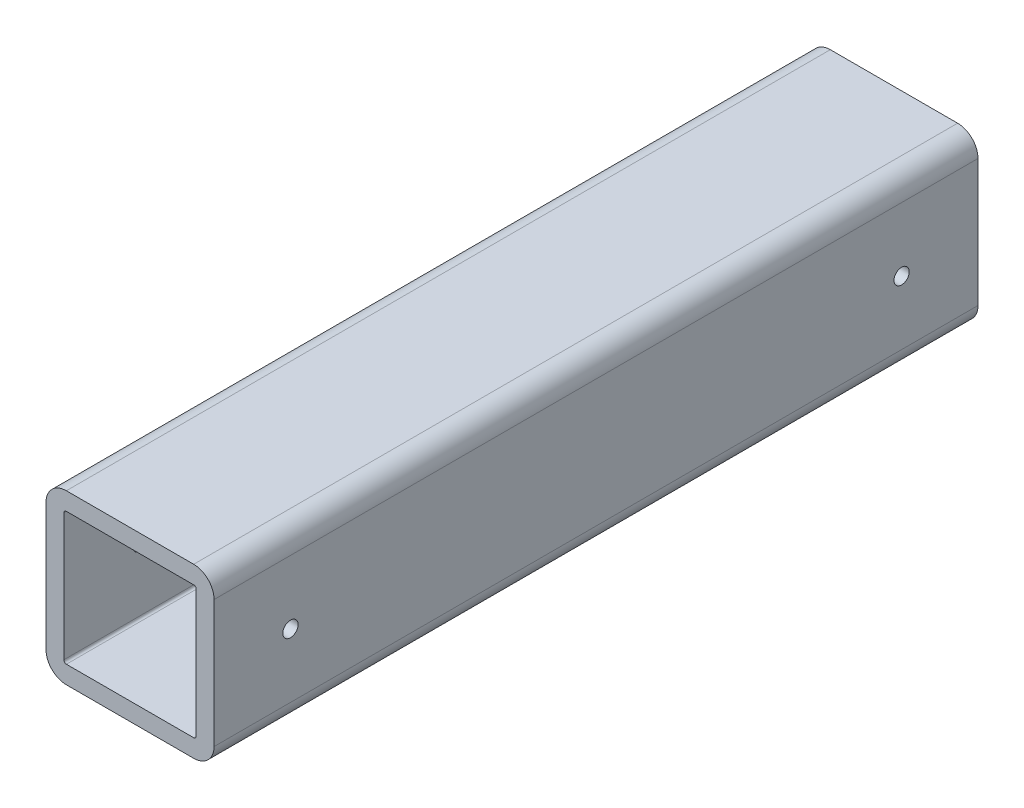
ISO-10303-21;
HEADER;
FILE_DESCRIPTION(('STEP AP214'),'2;1');
FILE_NAME('part.step','',(''),(''),'','','');
FILE_SCHEMA(('AUTOMOTIVE_DESIGN { 1 0 10303 214 1 1 1 1 }'));
ENDSEC;
DATA;
#1=APPLICATION_CONTEXT('core data for automotive mechanical design processes');
#2=APPLICATION_PROTOCOL_DEFINITION('international standard','automotive_design',2000,#1);
#3=PRODUCT_CONTEXT('',#1,'mechanical');
#4=PRODUCT('Part','Part','',(#3));
#5=PRODUCT_RELATED_PRODUCT_CATEGORY('part','',(#4));
#6=PRODUCT_DEFINITION_FORMATION('','',#4);
#7=PRODUCT_DEFINITION_CONTEXT('part definition',#1,'design');
#8=PRODUCT_DEFINITION('design','',#6,#7);
#9=PRODUCT_DEFINITION_SHAPE('','',#8);
#10=(LENGTH_UNIT() NAMED_UNIT(*) SI_UNIT(.MILLI.,.METRE.));
#11=(NAMED_UNIT(*) PLANE_ANGLE_UNIT() SI_UNIT($,.RADIAN.));
#12=(NAMED_UNIT(*) SI_UNIT($,.STERADIAN.) SOLID_ANGLE_UNIT());
#13=UNCERTAINTY_MEASURE_WITH_UNIT(LENGTH_MEASURE(1.E-05),#10,'distance_accuracy_value','');
#14=(GEOMETRIC_REPRESENTATION_CONTEXT(3) GLOBAL_UNCERTAINTY_ASSIGNED_CONTEXT((#13)) GLOBAL_UNIT_ASSIGNED_CONTEXT((#10,
#11,#12)) REPRESENTATION_CONTEXT('',''));
#15=CARTESIAN_POINT('',(0.,0.,0.));
#16=DIRECTION('',(0.,0.,1.));
#17=DIRECTION('',(1.,0.,0.));
#18=AXIS2_PLACEMENT_3D('',#15,#16,#17);
#19=CARTESIAN_POINT('',(58.,-58.,300.));
#20=DIRECTION('',(0.,0.,1.));
#21=DIRECTION('',(1.,0.,0.));
#22=AXIS2_PLACEMENT_3D('',#19,#20,#21);
#23=PLANE('',#22);
#24=CARTESIAN_POINT('',(58.,-58.,300.));
#25=DIRECTION('',(0.,0.,1.));
#26=DIRECTION('',(1.,0.,0.));
#27=AXIS2_PLACEMENT_3D('',#24,#25,#26);
#28=CIRCLE('',#27,8.);
#29=CARTESIAN_POINT('',(58.,-66.,300.));
#30=VERTEX_POINT('',#29);
#31=CARTESIAN_POINT('',(66.,-58.,300.));
#32=VERTEX_POINT('',#31);
#33=EDGE_CURVE('E231',#30,#32,#28,.T.);
#34=ORIENTED_EDGE('',*,*,#33,.T.);
#35=DIRECTION('',(0.,1.,0.));
#36=VECTOR('',#35,1.);
#37=CARTESIAN_POINT('',(66.,-8.,300.));
#38=LINE('',#37,#36);
#39=CARTESIAN_POINT('',(66.,-8.,300.));
#40=VERTEX_POINT('',#39);
#41=EDGE_CURVE('E234',#32,#40,#38,.T.);
#42=ORIENTED_EDGE('',*,*,#41,.T.);
#43=CARTESIAN_POINT('',(58.,-8.,300.));
#44=DIRECTION('',(0.,0.,1.));
#45=DIRECTION('',(1.,0.,0.));
#46=AXIS2_PLACEMENT_3D('',#43,#44,#45);
#47=CIRCLE('',#46,8.);
#48=CARTESIAN_POINT('',(58.,0.,300.));
#49=VERTEX_POINT('',#48);
#50=EDGE_CURVE('E236',#40,#49,#47,.T.);
#51=ORIENTED_EDGE('',*,*,#50,.T.);
#52=DIRECTION('',(-1.,0.,0.));
#53=VECTOR('',#52,1.);
#54=CARTESIAN_POINT('',(8.,0.,300.));
#55=LINE('',#54,#53);
#56=CARTESIAN_POINT('',(8.,0.,300.));
#57=VERTEX_POINT('',#56);
#58=EDGE_CURVE('E238',#49,#57,#55,.T.);
#59=ORIENTED_EDGE('',*,*,#58,.T.);
#60=CARTESIAN_POINT('',(8.,-8.,300.));
#61=DIRECTION('',(0.,0.,1.));
#62=DIRECTION('',(1.,0.,0.));
#63=AXIS2_PLACEMENT_3D('',#60,#61,#62);
#64=CIRCLE('',#63,8.);
#65=CARTESIAN_POINT('',(0.,-8.,300.));
#66=VERTEX_POINT('',#65);
#67=EDGE_CURVE('E240',#57,#66,#64,.T.);
#68=ORIENTED_EDGE('',*,*,#67,.T.);
#69=DIRECTION('',(0.,-1.,0.));
#70=VECTOR('',#69,1.);
#71=CARTESIAN_POINT('',(0.,-8.,300.));
#72=LINE('',#71,#70);
#73=CARTESIAN_POINT('',(0.,-58.,300.));
#74=VERTEX_POINT('',#73);
#75=EDGE_CURVE('E242',#66,#74,#72,.T.);
#76=ORIENTED_EDGE('',*,*,#75,.T.);
#77=CARTESIAN_POINT('',(8.00000000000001,-58.,300.));
#78=DIRECTION('',(0.,0.,1.));
#79=DIRECTION('',(1.,0.,0.));
#80=AXIS2_PLACEMENT_3D('',#77,#78,#79);
#81=CIRCLE('',#80,8.);
#82=CARTESIAN_POINT('',(8.00000000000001,-66.,300.));
#83=VERTEX_POINT('',#82);
#84=EDGE_CURVE('E244',#74,#83,#81,.T.);
#85=ORIENTED_EDGE('',*,*,#84,.T.);
#86=DIRECTION('',(1.,0.,0.));
#87=VECTOR('',#86,1.);
#88=CARTESIAN_POINT('',(8.00000000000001,-66.,300.));
#89=LINE('',#88,#87);
#90=EDGE_CURVE('E246',#83,#30,#89,.T.);
#91=ORIENTED_EDGE('',*,*,#90,.T.);
#92=EDGE_LOOP('',(#34,#42,#51,#59,#68,#76,#85,#91));
#93=FACE_BOUND('',#92,.T.);
#94=DIRECTION('',(0.,-1.,0.));
#95=VECTOR('',#94,1.);
#96=CARTESIAN_POINT('',(7.,-8.,300.));
#97=LINE('',#96,#95);
#98=CARTESIAN_POINT('',(7.,-8.,300.));
#99=VERTEX_POINT('',#98);
#100=CARTESIAN_POINT('',(7.00000000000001,-58.,300.));
#101=VERTEX_POINT('',#100);
#102=EDGE_CURVE('E189',#99,#101,#97,.T.);
#103=ORIENTED_EDGE('',*,*,#102,.F.);
#104=CARTESIAN_POINT('',(8.,-8.,300.));
#105=DIRECTION('',(0.,0.,1.));
#106=DIRECTION('',(1.,0.,0.));
#107=AXIS2_PLACEMENT_3D('',#104,#105,#106);
#108=CIRCLE('',#107,1.);
#109=CARTESIAN_POINT('',(8.,-7.,300.));
#110=VERTEX_POINT('',#109);
#111=EDGE_CURVE('E161',#110,#99,#108,.T.);
#112=ORIENTED_EDGE('',*,*,#111,.F.);
#113=DIRECTION('',(-1.,0.,0.));
#114=VECTOR('',#113,1.);
#115=CARTESIAN_POINT('',(8.,-7.,300.));
#116=LINE('',#115,#114);
#117=CARTESIAN_POINT('',(58.,-7.,300.));
#118=VERTEX_POINT('',#117);
#119=EDGE_CURVE('E201',#118,#110,#116,.T.);
#120=ORIENTED_EDGE('',*,*,#119,.F.);
#121=CARTESIAN_POINT('',(58.,-8.,300.));
#122=DIRECTION('',(0.,0.,1.));
#123=DIRECTION('',(1.,0.,0.));
#124=AXIS2_PLACEMENT_3D('',#121,#122,#123);
#125=CIRCLE('',#124,1.);
#126=CARTESIAN_POINT('',(59.,-8.,300.));
#127=VERTEX_POINT('',#126);
#128=EDGE_CURVE('E199',#127,#118,#125,.T.);
#129=ORIENTED_EDGE('',*,*,#128,.F.);
#130=DIRECTION('',(0.,1.,0.));
#131=VECTOR('',#130,1.);
#132=CARTESIAN_POINT('',(59.,-8.,300.));
#133=LINE('',#132,#131);
#134=CARTESIAN_POINT('',(59.,-58.,300.));
#135=VERTEX_POINT('',#134);
#136=EDGE_CURVE('E197',#135,#127,#133,.T.);
#137=ORIENTED_EDGE('',*,*,#136,.F.);
#138=CARTESIAN_POINT('',(58.,-58.,300.));
#139=DIRECTION('',(0.,0.,1.));
#140=DIRECTION('',(1.,0.,0.));
#141=AXIS2_PLACEMENT_3D('',#138,#139,#140);
#142=CIRCLE('',#141,0.999999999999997);
#143=CARTESIAN_POINT('',(58.,-59.,300.));
#144=VERTEX_POINT('',#143);
#145=EDGE_CURVE('E195',#144,#135,#142,.T.);
#146=ORIENTED_EDGE('',*,*,#145,.F.);
#147=DIRECTION('',(1.,0.,0.));
#148=VECTOR('',#147,1.);
#149=CARTESIAN_POINT('',(8.00000000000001,-59.,300.));
#150=LINE('',#149,#148);
#151=CARTESIAN_POINT('',(8.00000000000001,-59.,300.));
#152=VERTEX_POINT('',#151);
#153=EDGE_CURVE('E193',#152,#144,#150,.T.);
#154=ORIENTED_EDGE('',*,*,#153,.F.);
#155=CARTESIAN_POINT('',(8.00000000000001,-58.,300.));
#156=DIRECTION('',(0.,0.,1.));
#157=DIRECTION('',(1.,0.,0.));
#158=AXIS2_PLACEMENT_3D('',#155,#156,#157);
#159=CIRCLE('',#158,1.);
#160=EDGE_CURVE('E191',#101,#152,#159,.T.);
#161=ORIENTED_EDGE('',*,*,#160,.F.);
#162=EDGE_LOOP('',(#103,#112,#120,#129,#137,#146,#154,#161));
#163=FACE_BOUND('',#162,.T.);
#164=ADVANCED_FACE('F31',(#93,#163),#23,.T.);
#165=CARTESIAN_POINT('',(58.,-58.,0.));
#166=DIRECTION('',(0.,0.,1.));
#167=DIRECTION('',(1.,0.,0.));
#168=AXIS2_PLACEMENT_3D('',#165,#166,#167);
#169=PLANE('',#168);
#170=CARTESIAN_POINT('',(58.,-58.,0.));
#171=DIRECTION('',(0.,0.,1.));
#172=DIRECTION('',(1.,0.,0.));
#173=AXIS2_PLACEMENT_3D('',#170,#171,#172);
#174=CIRCLE('',#173,8.);
#175=CARTESIAN_POINT('',(58.,-66.,0.));
#176=VERTEX_POINT('',#175);
#177=CARTESIAN_POINT('',(66.,-58.,0.));
#178=VERTEX_POINT('',#177);
#179=EDGE_CURVE('E162',#176,#178,#174,.T.);
#180=ORIENTED_EDGE('',*,*,#179,.F.);
#181=DIRECTION('',(1.,0.,0.));
#182=VECTOR('',#181,1.);
#183=CARTESIAN_POINT('',(8.00000000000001,-66.,0.));
#184=LINE('',#183,#182);
#185=CARTESIAN_POINT('',(8.00000000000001,-66.,0.));
#186=VERTEX_POINT('',#185);
#187=EDGE_CURVE('E229',#186,#176,#184,.T.);
#188=ORIENTED_EDGE('',*,*,#187,.F.);
#189=CARTESIAN_POINT('',(8.00000000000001,-58.,0.));
#190=DIRECTION('',(0.,0.,1.));
#191=DIRECTION('',(1.,0.,0.));
#192=AXIS2_PLACEMENT_3D('',#189,#190,#191);
#193=CIRCLE('',#192,8.);
#194=CARTESIAN_POINT('',(0.,-58.,0.));
#195=VERTEX_POINT('',#194);
#196=EDGE_CURVE('E227',#195,#186,#193,.T.);
#197=ORIENTED_EDGE('',*,*,#196,.F.);
#198=DIRECTION('',(0.,-1.,0.));
#199=VECTOR('',#198,1.);
#200=CARTESIAN_POINT('',(0.,-8.,0.));
#201=LINE('',#200,#199);
#202=CARTESIAN_POINT('',(0.,-8.,0.));
#203=VERTEX_POINT('',#202);
#204=EDGE_CURVE('E225',#203,#195,#201,.T.);
#205=ORIENTED_EDGE('',*,*,#204,.F.);
#206=CARTESIAN_POINT('',(8.,-8.,0.));
#207=DIRECTION('',(0.,0.,1.));
#208=DIRECTION('',(1.,0.,0.));
#209=AXIS2_PLACEMENT_3D('',#206,#207,#208);
#210=CIRCLE('',#209,8.);
#211=CARTESIAN_POINT('',(8.,0.,0.));
#212=VERTEX_POINT('',#211);
#213=EDGE_CURVE('E223',#212,#203,#210,.T.);
#214=ORIENTED_EDGE('',*,*,#213,.F.);
#215=DIRECTION('',(-1.,0.,0.));
#216=VECTOR('',#215,1.);
#217=CARTESIAN_POINT('',(8.,0.,0.));
#218=LINE('',#217,#216);
#219=CARTESIAN_POINT('',(58.,0.,0.));
#220=VERTEX_POINT('',#219);
#221=EDGE_CURVE('E221',#220,#212,#218,.T.);
#222=ORIENTED_EDGE('',*,*,#221,.F.);
#223=CARTESIAN_POINT('',(58.,-8.,0.));
#224=DIRECTION('',(0.,0.,1.));
#225=DIRECTION('',(1.,0.,0.));
#226=AXIS2_PLACEMENT_3D('',#223,#224,#225);
#227=CIRCLE('',#226,8.);
#228=CARTESIAN_POINT('',(66.,-8.,0.));
#229=VERTEX_POINT('',#228);
#230=EDGE_CURVE('E219',#229,#220,#227,.T.);
#231=ORIENTED_EDGE('',*,*,#230,.F.);
#232=DIRECTION('',(0.,1.,0.));
#233=VECTOR('',#232,1.);
#234=CARTESIAN_POINT('',(66.,-8.,0.));
#235=LINE('',#234,#233);
#236=EDGE_CURVE('E217',#178,#229,#235,.T.);
#237=ORIENTED_EDGE('',*,*,#236,.F.);
#238=EDGE_LOOP('',(#180,#188,#197,#205,#214,#222,#231,#237));
#239=FACE_BOUND('',#238,.T.);
#240=CARTESIAN_POINT('',(8.,-8.,0.));
#241=DIRECTION('',(0.,0.,1.));
#242=DIRECTION('',(1.,0.,0.));
#243=AXIS2_PLACEMENT_3D('',#240,#241,#242);
#244=CIRCLE('',#243,1.);
#245=CARTESIAN_POINT('',(8.,-7.,0.));
#246=VERTEX_POINT('',#245);
#247=CARTESIAN_POINT('',(7.,-8.,0.));
#248=VERTEX_POINT('',#247);
#249=EDGE_CURVE('E56',#246,#248,#244,.T.);
#250=ORIENTED_EDGE('',*,*,#249,.T.);
#251=DIRECTION('',(0.,-1.,0.));
#252=VECTOR('',#251,1.);
#253=CARTESIAN_POINT('',(7.,-8.,0.));
#254=LINE('',#253,#252);
#255=CARTESIAN_POINT('',(7.00000000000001,-58.,0.));
#256=VERTEX_POINT('',#255);
#257=EDGE_CURVE('E148',#248,#256,#254,.T.);
#258=ORIENTED_EDGE('',*,*,#257,.T.);
#259=CARTESIAN_POINT('',(8.00000000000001,-58.,0.));
#260=DIRECTION('',(0.,0.,1.));
#261=DIRECTION('',(1.,0.,0.));
#262=AXIS2_PLACEMENT_3D('',#259,#260,#261);
#263=CIRCLE('',#262,1.);
#264=CARTESIAN_POINT('',(8.00000000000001,-59.,0.));
#265=VERTEX_POINT('',#264);
#266=EDGE_CURVE('E157',#256,#265,#263,.T.);
#267=ORIENTED_EDGE('',*,*,#266,.T.);
#268=DIRECTION('',(1.,0.,0.));
#269=VECTOR('',#268,1.);
#270=CARTESIAN_POINT('',(8.00000000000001,-59.,0.));
#271=LINE('',#270,#269);
#272=CARTESIAN_POINT('',(58.,-59.,0.));
#273=VERTEX_POINT('',#272);
#274=EDGE_CURVE('E176',#265,#273,#271,.T.);
#275=ORIENTED_EDGE('',*,*,#274,.T.);
#276=CARTESIAN_POINT('',(58.,-58.,0.));
#277=DIRECTION('',(0.,0.,1.));
#278=DIRECTION('',(1.,0.,0.));
#279=AXIS2_PLACEMENT_3D('',#276,#277,#278);
#280=CIRCLE('',#279,0.999999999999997);
#281=CARTESIAN_POINT('',(59.,-58.,0.));
#282=VERTEX_POINT('',#281);
#283=EDGE_CURVE('E179',#273,#282,#280,.T.);
#284=ORIENTED_EDGE('',*,*,#283,.T.);
#285=DIRECTION('',(0.,1.,0.));
#286=VECTOR('',#285,1.);
#287=CARTESIAN_POINT('',(59.,-8.,0.));
#288=LINE('',#287,#286);
#289=CARTESIAN_POINT('',(59.,-8.,0.));
#290=VERTEX_POINT('',#289);
#291=EDGE_CURVE('E182',#282,#290,#288,.T.);
#292=ORIENTED_EDGE('',*,*,#291,.T.);
#293=CARTESIAN_POINT('',(58.,-8.,0.));
#294=DIRECTION('',(0.,0.,1.));
#295=DIRECTION('',(1.,0.,0.));
#296=AXIS2_PLACEMENT_3D('',#293,#294,#295);
#297=CIRCLE('',#296,1.);
#298=CARTESIAN_POINT('',(58.,-7.,0.));
#299=VERTEX_POINT('',#298);
#300=EDGE_CURVE('E185',#290,#299,#297,.T.);
#301=ORIENTED_EDGE('',*,*,#300,.T.);
#302=DIRECTION('',(-1.,0.,0.));
#303=VECTOR('',#302,1.);
#304=CARTESIAN_POINT('',(8.,-7.,0.));
#305=LINE('',#304,#303);
#306=EDGE_CURVE('E167',#299,#246,#305,.T.);
#307=ORIENTED_EDGE('',*,*,#306,.T.);
#308=EDGE_LOOP('',(#250,#258,#267,#275,#284,#292,#301,#307));
#309=FACE_BOUND('',#308,.T.);
#310=ADVANCED_FACE('F165',(#239,#309),#169,.F.);
#311=CARTESIAN_POINT('',(58.,-58.,300.));
#312=DIRECTION('',(0.,0.,-1.));
#313=DIRECTION('',(-1.,0.,0.));
#314=AXIS2_PLACEMENT_3D('',#311,#312,#313);
#315=CYLINDRICAL_SURFACE('',#314,8.);
#316=ORIENTED_EDGE('',*,*,#179,.T.);
#317=DIRECTION('',(0.,0.,-1.));
#318=VECTOR('',#317,1.);
#319=CARTESIAN_POINT('',(66.,-58.,300.));
#320=LINE('',#319,#318);
#321=EDGE_CURVE('E11',#32,#178,#320,.T.);
#322=ORIENTED_EDGE('',*,*,#321,.F.);
#323=ORIENTED_EDGE('',*,*,#33,.F.);
#324=DIRECTION('',(0.,0.,-1.));
#325=VECTOR('',#324,1.);
#326=CARTESIAN_POINT('',(58.,-66.,300.));
#327=LINE('',#326,#325);
#328=EDGE_CURVE('E248',#30,#176,#327,.T.);
#329=ORIENTED_EDGE('',*,*,#328,.T.);
#330=EDGE_LOOP('',(#316,#322,#323,#329));
#331=FACE_BOUND('',#330,.T.);
#332=ADVANCED_FACE('F33',(#331),#315,.T.);
#333=CARTESIAN_POINT('',(66.,-8.,300.));
#334=DIRECTION('',(-1.,0.,0.));
#335=DIRECTION('',(0.,0.,1.));
#336=AXIS2_PLACEMENT_3D('',#333,#334,#335);
#337=PLANE('',#336);
#338=CARTESIAN_POINT('',(66.,-33.,270.));
#339=DIRECTION('',(-1.,0.,0.));
#340=DIRECTION('',(0.,-1.,0.));
#341=AXIS2_PLACEMENT_3D('',#338,#339,#340);
#342=CIRCLE('',#341,2.99999999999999);
#343=CARTESIAN_POINT('',(66.,-36.,270.));
#344=VERTEX_POINT('',#343);
#345=EDGE_CURVE('E281',#344,#344,#342,.T.);
#346=ORIENTED_EDGE('',*,*,#345,.T.);
#347=EDGE_LOOP('',(#346));
#348=FACE_BOUND('',#347,.T.);
#349=CARTESIAN_POINT('',(66.,-33.,30.));
#350=DIRECTION('',(-1.,0.,0.));
#351=DIRECTION('',(0.,-1.,0.));
#352=AXIS2_PLACEMENT_3D('',#349,#350,#351);
#353=CIRCLE('',#352,3.);
#354=CARTESIAN_POINT('',(66.,-36.,30.));
#355=VERTEX_POINT('',#354);
#356=EDGE_CURVE('E268',#355,#355,#353,.T.);
#357=ORIENTED_EDGE('',*,*,#356,.T.);
#358=EDGE_LOOP('',(#357));
#359=FACE_BOUND('',#358,.T.);
#360=ORIENTED_EDGE('',*,*,#236,.T.);
#361=DIRECTION('',(0.,0.,-1.));
#362=VECTOR('',#361,1.);
#363=CARTESIAN_POINT('',(66.,-8.,300.));
#364=LINE('',#363,#362);
#365=EDGE_CURVE('E40',#40,#229,#364,.T.);
#366=ORIENTED_EDGE('',*,*,#365,.F.);
#367=ORIENTED_EDGE('',*,*,#41,.F.);
#368=ORIENTED_EDGE('',*,*,#321,.T.);
#369=EDGE_LOOP('',(#360,#366,#367,#368));
#370=FACE_BOUND('',#369,.T.);
#371=ADVANCED_FACE('F333',(#348,#359,#370),#337,.F.);
#372=CARTESIAN_POINT('',(58.,-8.,300.));
#373=DIRECTION('',(0.,0.,-1.));
#374=DIRECTION('',(-1.,0.,0.));
#375=AXIS2_PLACEMENT_3D('',#372,#373,#374);
#376=CYLINDRICAL_SURFACE('',#375,8.);
#377=ORIENTED_EDGE('',*,*,#230,.T.);
#378=DIRECTION('',(0.,0.,-1.));
#379=VECTOR('',#378,1.);
#380=CARTESIAN_POINT('',(58.,0.,300.));
#381=LINE('',#380,#379);
#382=EDGE_CURVE('E263',#49,#220,#381,.T.);
#383=ORIENTED_EDGE('',*,*,#382,.F.);
#384=ORIENTED_EDGE('',*,*,#50,.F.);
#385=ORIENTED_EDGE('',*,*,#365,.T.);
#386=EDGE_LOOP('',(#377,#383,#384,#385));
#387=FACE_BOUND('',#386,.T.);
#388=ADVANCED_FACE('F331',(#387),#376,.T.);
#389=CARTESIAN_POINT('',(8.,0.,300.));
#390=DIRECTION('',(0.,-1.,0.));
#391=DIRECTION('',(0.,0.,-1.));
#392=AXIS2_PLACEMENT_3D('',#389,#390,#391);
#393=PLANE('',#392);
#394=ORIENTED_EDGE('',*,*,#221,.T.);
#395=DIRECTION('',(0.,0.,-1.));
#396=VECTOR('',#395,1.);
#397=CARTESIAN_POINT('',(8.,0.,300.));
#398=LINE('',#397,#396);
#399=EDGE_CURVE('E260',#57,#212,#398,.T.);
#400=ORIENTED_EDGE('',*,*,#399,.F.);
#401=ORIENTED_EDGE('',*,*,#58,.F.);
#402=ORIENTED_EDGE('',*,*,#382,.T.);
#403=EDGE_LOOP('',(#394,#400,#401,#402));
#404=FACE_BOUND('',#403,.T.);
#405=ADVANCED_FACE('F327',(#404),#393,.F.);
#406=CARTESIAN_POINT('',(8.,-8.,300.));
#407=DIRECTION('',(0.,0.,-1.));
#408=DIRECTION('',(-1.,0.,0.));
#409=AXIS2_PLACEMENT_3D('',#406,#407,#408);
#410=CYLINDRICAL_SURFACE('',#409,8.);
#411=ORIENTED_EDGE('',*,*,#213,.T.);
#412=DIRECTION('',(0.,0.,-1.));
#413=VECTOR('',#412,1.);
#414=CARTESIAN_POINT('',(0.,-8.,300.));
#415=LINE('',#414,#413);
#416=EDGE_CURVE('E257',#66,#203,#415,.T.);
#417=ORIENTED_EDGE('',*,*,#416,.F.);
#418=ORIENTED_EDGE('',*,*,#67,.F.);
#419=ORIENTED_EDGE('',*,*,#399,.T.);
#420=EDGE_LOOP('',(#411,#417,#418,#419));
#421=FACE_BOUND('',#420,.T.);
#422=ADVANCED_FACE('F294',(#421),#410,.T.);
#423=CARTESIAN_POINT('',(0.,-8.,300.));
#424=DIRECTION('',(1.,0.,0.));
#425=DIRECTION('',(0.,1.,0.));
#426=AXIS2_PLACEMENT_3D('',#423,#424,#425);
#427=PLANE('',#426);
#428=CARTESIAN_POINT('',(0.,-33.,270.));
#429=DIRECTION('',(-1.,0.,0.));
#430=DIRECTION('',(0.,-1.,0.));
#431=AXIS2_PLACEMENT_3D('',#428,#429,#430);
#432=CIRCLE('',#431,2.99999999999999);
#433=CARTESIAN_POINT('',(0.,-36.,270.));
#434=VERTEX_POINT('',#433);
#435=EDGE_CURVE('E284',#434,#434,#432,.T.);
#436=ORIENTED_EDGE('',*,*,#435,.F.);
#437=EDGE_LOOP('',(#436));
#438=FACE_BOUND('',#437,.T.);
#439=CARTESIAN_POINT('',(0.,-33.,30.));
#440=DIRECTION('',(-1.,0.,0.));
#441=DIRECTION('',(0.,-1.,0.));
#442=AXIS2_PLACEMENT_3D('',#439,#440,#441);
#443=CIRCLE('',#442,3.);
#444=CARTESIAN_POINT('',(0.,-36.,30.));
#445=VERTEX_POINT('',#444);
#446=EDGE_CURVE('E272',#445,#445,#443,.T.);
#447=ORIENTED_EDGE('',*,*,#446,.F.);
#448=EDGE_LOOP('',(#447));
#449=FACE_BOUND('',#448,.T.);
#450=ORIENTED_EDGE('',*,*,#204,.T.);
#451=DIRECTION('',(0.,0.,-1.));
#452=VECTOR('',#451,1.);
#453=CARTESIAN_POINT('',(0.,-58.,300.));
#454=LINE('',#453,#452);
#455=EDGE_CURVE('E254',#74,#195,#454,.T.);
#456=ORIENTED_EDGE('',*,*,#455,.F.);
#457=ORIENTED_EDGE('',*,*,#75,.F.);
#458=ORIENTED_EDGE('',*,*,#416,.T.);
#459=EDGE_LOOP('',(#450,#456,#457,#458));
#460=FACE_BOUND('',#459,.T.);
#461=ADVANCED_FACE('F290',(#438,#449,#460),#427,.F.);
#462=CARTESIAN_POINT('',(8.00000000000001,-58.,300.));
#463=DIRECTION('',(0.,0.,-1.));
#464=DIRECTION('',(-1.,0.,0.));
#465=AXIS2_PLACEMENT_3D('',#462,#463,#464);
#466=CYLINDRICAL_SURFACE('',#465,8.);
#467=ORIENTED_EDGE('',*,*,#196,.T.);
#468=DIRECTION('',(0.,0.,-1.));
#469=VECTOR('',#468,1.);
#470=CARTESIAN_POINT('',(8.00000000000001,-66.,300.));
#471=LINE('',#470,#469);
#472=EDGE_CURVE('E251',#83,#186,#471,.T.);
#473=ORIENTED_EDGE('',*,*,#472,.F.);
#474=ORIENTED_EDGE('',*,*,#84,.F.);
#475=ORIENTED_EDGE('',*,*,#455,.T.);
#476=EDGE_LOOP('',(#467,#473,#474,#475));
#477=FACE_BOUND('',#476,.T.);
#478=ADVANCED_FACE('F293',(#477),#466,.T.);
#479=CARTESIAN_POINT('',(8.00000000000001,-66.,300.));
#480=DIRECTION('',(0.,1.,0.));
#481=DIRECTION('',(0.,0.,1.));
#482=AXIS2_PLACEMENT_3D('',#479,#480,#481);
#483=PLANE('',#482);
#484=ORIENTED_EDGE('',*,*,#187,.T.);
#485=ORIENTED_EDGE('',*,*,#328,.F.);
#486=ORIENTED_EDGE('',*,*,#90,.F.);
#487=ORIENTED_EDGE('',*,*,#472,.T.);
#488=EDGE_LOOP('',(#484,#485,#486,#487));
#489=FACE_BOUND('',#488,.T.);
#490=ADVANCED_FACE('F312',(#489),#483,.F.);
#491=CARTESIAN_POINT('',(8.,-8.,300.));
#492=DIRECTION('',(0.,0.,-1.));
#493=DIRECTION('',(-1.,0.,0.));
#494=AXIS2_PLACEMENT_3D('',#491,#492,#493);
#495=CYLINDRICAL_SURFACE('',#494,1.);
#496=ORIENTED_EDGE('',*,*,#249,.F.);
#497=DIRECTION('',(0.,0.,-1.));
#498=VECTOR('',#497,1.);
#499=CARTESIAN_POINT('',(8.,-7.,300.));
#500=LINE('',#499,#498);
#501=EDGE_CURVE('E203',#110,#246,#500,.T.);
#502=ORIENTED_EDGE('',*,*,#501,.F.);
#503=ORIENTED_EDGE('',*,*,#111,.T.);
#504=DIRECTION('',(0.,0.,-1.));
#505=VECTOR('',#504,1.);
#506=CARTESIAN_POINT('',(7.,-8.,300.));
#507=LINE('',#506,#505);
#508=EDGE_CURVE('E150',#99,#248,#507,.T.);
#509=ORIENTED_EDGE('',*,*,#508,.T.);
#510=EDGE_LOOP('',(#496,#502,#503,#509));
#511=FACE_BOUND('',#510,.T.);
#512=ADVANCED_FACE('F159',(#511),#495,.F.);
#513=CARTESIAN_POINT('',(7.,-8.,300.));
#514=DIRECTION('',(1.,0.,0.));
#515=DIRECTION('',(0.,1.,0.));
#516=AXIS2_PLACEMENT_3D('',#513,#514,#515);
#517=PLANE('',#516);
#518=CARTESIAN_POINT('',(7.,-33.,270.));
#519=DIRECTION('',(1.,0.,0.));
#520=DIRECTION('',(0.,1.,0.));
#521=AXIS2_PLACEMENT_3D('',#518,#519,#520);
#522=CIRCLE('',#521,2.99999999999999);
#523=CARTESIAN_POINT('',(7.,-30.,270.));
#524=VERTEX_POINT('',#523);
#525=EDGE_CURVE('E276',#524,#524,#522,.T.);
#526=ORIENTED_EDGE('',*,*,#525,.F.);
#527=EDGE_LOOP('',(#526));
#528=FACE_BOUND('',#527,.T.);
#529=CARTESIAN_POINT('',(7.,-33.,30.));
#530=DIRECTION('',(1.,0.,0.));
#531=DIRECTION('',(0.,1.,0.));
#532=AXIS2_PLACEMENT_3D('',#529,#530,#531);
#533=CIRCLE('',#532,3.);
#534=CARTESIAN_POINT('',(7.,-30.,30.));
#535=VERTEX_POINT('',#534);
#536=EDGE_CURVE('E168',#535,#535,#533,.T.);
#537=ORIENTED_EDGE('',*,*,#536,.F.);
#538=EDGE_LOOP('',(#537));
#539=FACE_BOUND('',#538,.T.);
#540=ORIENTED_EDGE('',*,*,#257,.F.);
#541=ORIENTED_EDGE('',*,*,#508,.F.);
#542=ORIENTED_EDGE('',*,*,#102,.T.);
#543=DIRECTION('',(0.,0.,-1.));
#544=VECTOR('',#543,1.);
#545=CARTESIAN_POINT('',(7.00000000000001,-58.,300.));
#546=LINE('',#545,#544);
#547=EDGE_CURVE('E153',#101,#256,#546,.T.);
#548=ORIENTED_EDGE('',*,*,#547,.T.);
#549=EDGE_LOOP('',(#540,#541,#542,#548));
#550=FACE_BOUND('',#549,.T.);
#551=ADVANCED_FACE('F149',(#528,#539,#550),#517,.T.);
#552=CARTESIAN_POINT('',(8.00000000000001,-58.,300.));
#553=DIRECTION('',(0.,0.,-1.));
#554=DIRECTION('',(-1.,0.,0.));
#555=AXIS2_PLACEMENT_3D('',#552,#553,#554);
#556=CYLINDRICAL_SURFACE('',#555,1.);
#557=ORIENTED_EDGE('',*,*,#266,.F.);
#558=ORIENTED_EDGE('',*,*,#547,.F.);
#559=ORIENTED_EDGE('',*,*,#160,.T.);
#560=DIRECTION('',(0.,0.,-1.));
#561=VECTOR('',#560,1.);
#562=CARTESIAN_POINT('',(8.00000000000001,-59.,300.));
#563=LINE('',#562,#561);
#564=EDGE_CURVE('E212',#152,#265,#563,.T.);
#565=ORIENTED_EDGE('',*,*,#564,.T.);
#566=EDGE_LOOP('',(#557,#558,#559,#565));
#567=FACE_BOUND('',#566,.T.);
#568=ADVANCED_FACE('F387',(#567),#556,.F.);
#569=CARTESIAN_POINT('',(8.00000000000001,-59.,300.));
#570=DIRECTION('',(0.,1.,0.));
#571=DIRECTION('',(0.,0.,1.));
#572=AXIS2_PLACEMENT_3D('',#569,#570,#571);
#573=PLANE('',#572);
#574=ORIENTED_EDGE('',*,*,#274,.F.);
#575=ORIENTED_EDGE('',*,*,#564,.F.);
#576=ORIENTED_EDGE('',*,*,#153,.T.);
#577=DIRECTION('',(0.,0.,-1.));
#578=VECTOR('',#577,1.);
#579=CARTESIAN_POINT('',(58.,-59.,300.));
#580=LINE('',#579,#578);
#581=EDGE_CURVE('E210',#144,#273,#580,.T.);
#582=ORIENTED_EDGE('',*,*,#581,.T.);
#583=EDGE_LOOP('',(#574,#575,#576,#582));
#584=FACE_BOUND('',#583,.T.);
#585=ADVANCED_FACE('F395',(#584),#573,.T.);
#586=CARTESIAN_POINT('',(58.,-58.,300.));
#587=DIRECTION('',(0.,0.,-1.));
#588=DIRECTION('',(-1.,0.,0.));
#589=AXIS2_PLACEMENT_3D('',#586,#587,#588);
#590=CYLINDRICAL_SURFACE('',#589,0.999999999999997);
#591=ORIENTED_EDGE('',*,*,#283,.F.);
#592=ORIENTED_EDGE('',*,*,#581,.F.);
#593=ORIENTED_EDGE('',*,*,#145,.T.);
#594=DIRECTION('',(0.,0.,-1.));
#595=VECTOR('',#594,1.);
#596=CARTESIAN_POINT('',(59.,-58.,300.));
#597=LINE('',#596,#595);
#598=EDGE_CURVE('E208',#135,#282,#597,.T.);
#599=ORIENTED_EDGE('',*,*,#598,.T.);
#600=EDGE_LOOP('',(#591,#592,#593,#599));
#601=FACE_BOUND('',#600,.T.);
#602=ADVANCED_FACE('F403',(#601),#590,.F.);
#603=CARTESIAN_POINT('',(59.,-8.,300.));
#604=DIRECTION('',(-1.,0.,0.));
#605=DIRECTION('',(0.,0.,1.));
#606=AXIS2_PLACEMENT_3D('',#603,#604,#605);
#607=PLANE('',#606);
#608=CARTESIAN_POINT('',(59.,-33.,270.));
#609=DIRECTION('',(-1.,0.,0.));
#610=DIRECTION('',(0.,0.,1.));
#611=AXIS2_PLACEMENT_3D('',#608,#609,#610);
#612=CIRCLE('',#611,2.99999999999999);
#613=CARTESIAN_POINT('',(59.,-33.,273.));
#614=VERTEX_POINT('',#613);
#615=EDGE_CURVE('E35',#614,#614,#612,.T.);
#616=ORIENTED_EDGE('',*,*,#615,.F.);
#617=EDGE_LOOP('',(#616));
#618=FACE_BOUND('',#617,.T.);
#619=CARTESIAN_POINT('',(59.,-33.,30.));
#620=DIRECTION('',(-1.,0.,0.));
#621=DIRECTION('',(0.,0.,1.));
#622=AXIS2_PLACEMENT_3D('',#619,#620,#621);
#623=CIRCLE('',#622,3.);
#624=CARTESIAN_POINT('',(59.,-33.,33.));
#625=VERTEX_POINT('',#624);
#626=EDGE_CURVE('E171',#625,#625,#623,.T.);
#627=ORIENTED_EDGE('',*,*,#626,.F.);
#628=EDGE_LOOP('',(#627));
#629=FACE_BOUND('',#628,.T.);
#630=ORIENTED_EDGE('',*,*,#291,.F.);
#631=ORIENTED_EDGE('',*,*,#598,.F.);
#632=ORIENTED_EDGE('',*,*,#136,.T.);
#633=DIRECTION('',(0.,0.,-1.));
#634=VECTOR('',#633,1.);
#635=CARTESIAN_POINT('',(59.,-8.,300.));
#636=LINE('',#635,#634);
#637=EDGE_CURVE('E206',#127,#290,#636,.T.);
#638=ORIENTED_EDGE('',*,*,#637,.T.);
#639=EDGE_LOOP('',(#630,#631,#632,#638));
#640=FACE_BOUND('',#639,.T.);
#641=ADVANCED_FACE('F411',(#618,#629,#640),#607,.T.);
#642=CARTESIAN_POINT('',(58.,-8.,300.));
#643=DIRECTION('',(0.,0.,-1.));
#644=DIRECTION('',(-1.,0.,0.));
#645=AXIS2_PLACEMENT_3D('',#642,#643,#644);
#646=CYLINDRICAL_SURFACE('',#645,1.);
#647=ORIENTED_EDGE('',*,*,#300,.F.);
#648=ORIENTED_EDGE('',*,*,#637,.F.);
#649=ORIENTED_EDGE('',*,*,#128,.T.);
#650=DIRECTION('',(0.,0.,-1.));
#651=VECTOR('',#650,1.);
#652=CARTESIAN_POINT('',(58.,-7.,300.));
#653=LINE('',#652,#651);
#654=EDGE_CURVE('E48',#118,#299,#653,.T.);
#655=ORIENTED_EDGE('',*,*,#654,.T.);
#656=EDGE_LOOP('',(#647,#648,#649,#655));
#657=FACE_BOUND('',#656,.T.);
#658=ADVANCED_FACE('F419',(#657),#646,.F.);
#659=CARTESIAN_POINT('',(8.,-7.,300.));
#660=DIRECTION('',(0.,-1.,0.));
#661=DIRECTION('',(0.,0.,-1.));
#662=AXIS2_PLACEMENT_3D('',#659,#660,#661);
#663=PLANE('',#662);
#664=ORIENTED_EDGE('',*,*,#306,.F.);
#665=ORIENTED_EDGE('',*,*,#654,.F.);
#666=ORIENTED_EDGE('',*,*,#119,.T.);
#667=ORIENTED_EDGE('',*,*,#501,.T.);
#668=EDGE_LOOP('',(#664,#665,#666,#667));
#669=FACE_BOUND('',#668,.T.);
#670=ADVANCED_FACE('F427',(#669),#663,.T.);
#671=CARTESIAN_POINT('',(66.,-33.,30.));
#672=DIRECTION('',(-1.,0.,0.));
#673=DIRECTION('',(0.,-1.,0.));
#674=AXIS2_PLACEMENT_3D('',#671,#672,#673);
#675=CYLINDRICAL_SURFACE('',#674,3.);
#676=ORIENTED_EDGE('',*,*,#626,.T.);
#677=EDGE_LOOP('',(#676));
#678=FACE_BOUND('',#677,.T.);
#679=ORIENTED_EDGE('',*,*,#356,.F.);
#680=EDGE_LOOP('',(#679));
#681=FACE_BOUND('',#680,.T.);
#682=ADVANCED_FACE('F435',(#678,#681),#675,.F.);
#683=ORIENTED_EDGE('',*,*,#536,.T.);
#684=EDGE_LOOP('',(#683));
#685=FACE_BOUND('',#684,.T.);
#686=ORIENTED_EDGE('',*,*,#446,.T.);
#687=EDGE_LOOP('',(#686));
#688=FACE_BOUND('',#687,.T.);
#689=ADVANCED_FACE('F442',(#685,#688),#675,.F.);
#690=CARTESIAN_POINT('',(66.,-33.,270.));
#691=DIRECTION('',(-1.,0.,0.));
#692=DIRECTION('',(0.,-1.,0.));
#693=AXIS2_PLACEMENT_3D('',#690,#691,#692);
#694=CYLINDRICAL_SURFACE('',#693,2.99999999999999);
#695=ORIENTED_EDGE('',*,*,#615,.T.);
#696=EDGE_LOOP('',(#695));
#697=FACE_BOUND('',#696,.T.);
#698=ORIENTED_EDGE('',*,*,#345,.F.);
#699=EDGE_LOOP('',(#698));
#700=FACE_BOUND('',#699,.T.);
#701=ADVANCED_FACE('F449',(#697,#700),#694,.F.);
#702=ORIENTED_EDGE('',*,*,#525,.T.);
#703=EDGE_LOOP('',(#702));
#704=FACE_BOUND('',#703,.T.);
#705=ORIENTED_EDGE('',*,*,#435,.T.);
#706=EDGE_LOOP('',(#705));
#707=FACE_BOUND('',#706,.T.);
#708=ADVANCED_FACE('F288',(#704,#707),#694,.F.);
#709=CLOSED_SHELL('',(#164,#310,#332,#371,#388,#405,#422,#461,#478,#490,#512,#551,#568,#585,
#602,#641,#658,#670,#682,#689,#701,#708));
#710=MANIFOLD_SOLID_BREP('B2',#709);
#711=ADVANCED_BREP_SHAPE_REPRESENTATION('',(#18,#710),#14);
#712=SHAPE_DEFINITION_REPRESENTATION(#9,#711);
ENDSEC;
END-ISO-10303-21;
